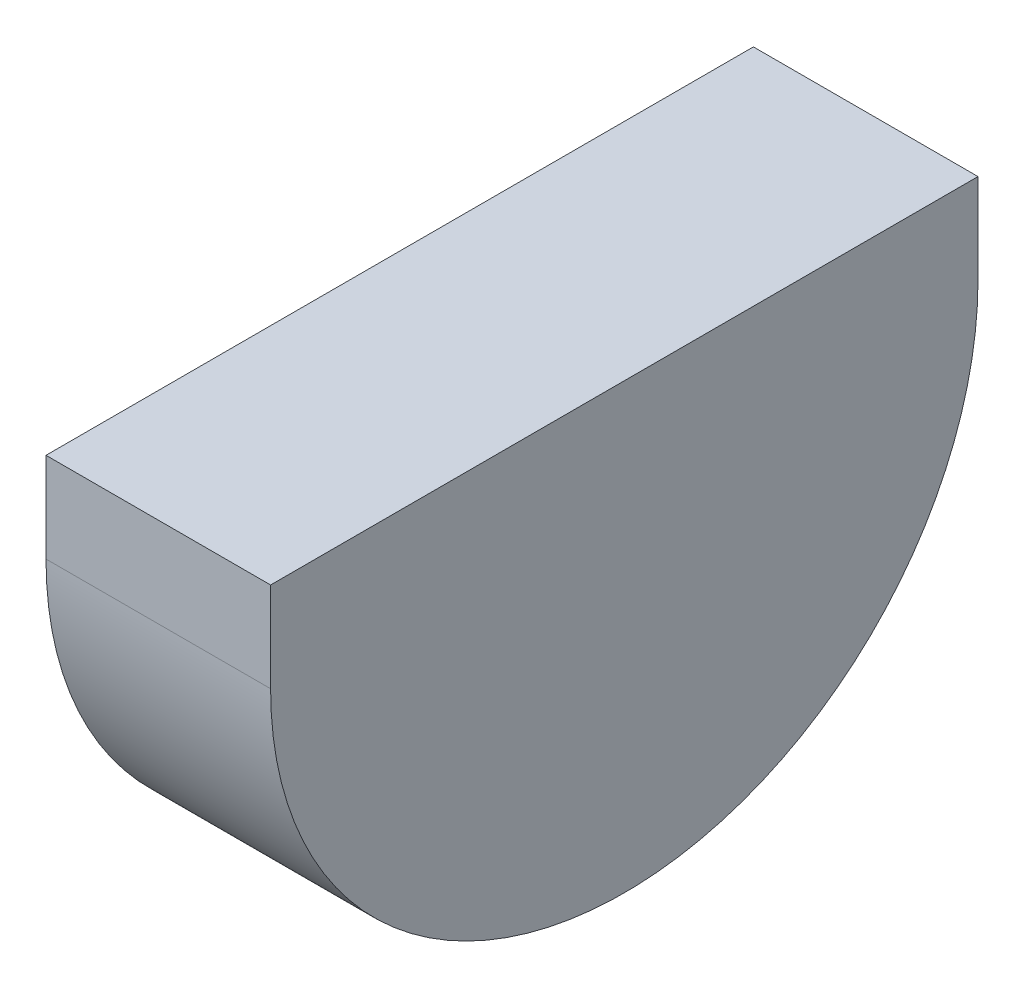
from build123d import *

# Parameters (mm, degrees)
EXTRUDE1_DEPTH = 1.5875
SKETCH2_W      = 3.175
SKETCH2_H      = 10
EXTRUDE2_DEPTH = 1.27


with BuildPart() as part:
    # Sketch1 → Extrude1 (new, symmetric)
    with BuildSketch(Plane(origin=(0, 0, 0), x_dir=(0, 0, -1), z_dir=(1, 0, 0))):
        with BuildLine():
            Line((-29.1046, 7.112), (-19.1046, 7.112))
            ThreePointArc((-19.1046, 7.112), (-24.1046, 2.112), (-29.1046, 7.112))
        make_face()
    extrude(amount=EXTRUDE1_DEPTH, both=True)

    # Sketch2 → Extrude2 (add)
    with BuildSketch(Plane(origin=(0, 7.112, 0), x_dir=(-1, 0, 0), z_dir=(0, 1, 0))):
        with Locations((0, 24.1046)):
            Rectangle(SKETCH2_W, SKETCH2_H)
    extrude(amount=EXTRUDE2_DEPTH)


solid = part.part
